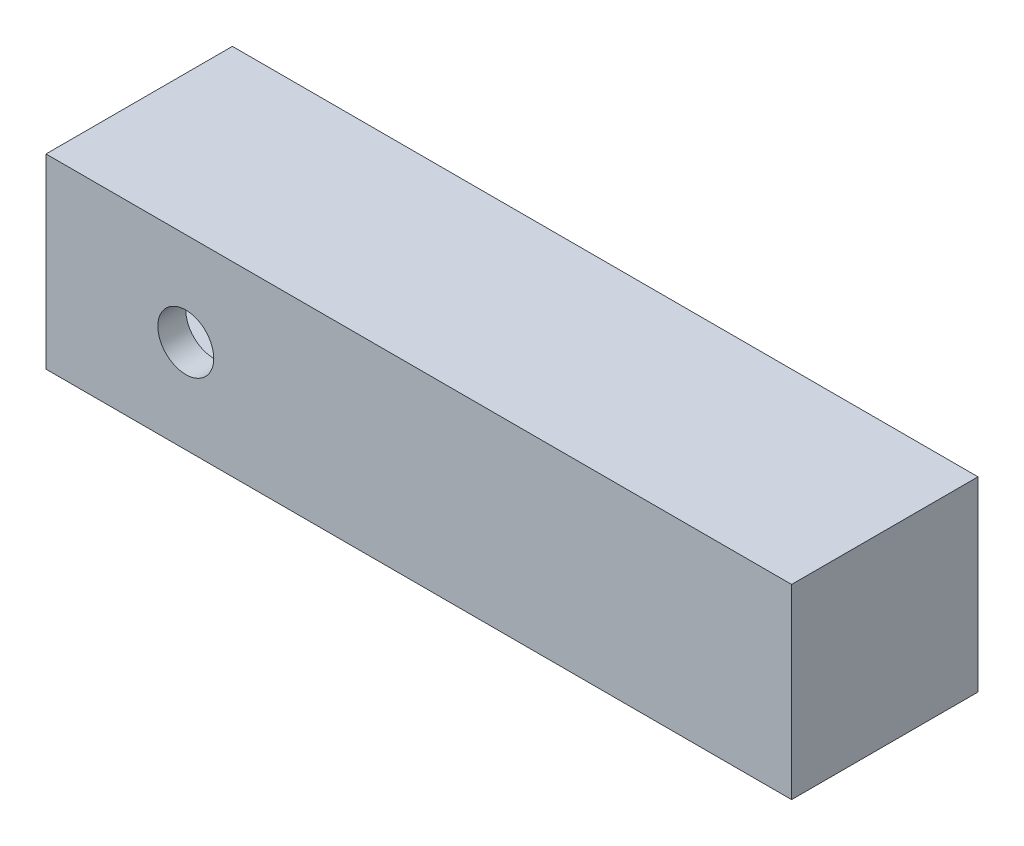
ISO-10303-21;
HEADER;
FILE_DESCRIPTION(('STEP AP214'),'2;1');
FILE_NAME('part.step','',(''),(''),'','','');
FILE_SCHEMA(('AUTOMOTIVE_DESIGN { 1 0 10303 214 1 1 1 1 }'));
ENDSEC;
DATA;
#1=APPLICATION_CONTEXT('core data for automotive mechanical design processes');
#2=APPLICATION_PROTOCOL_DEFINITION('international standard','automotive_design',2000,#1);
#3=PRODUCT_CONTEXT('',#1,'mechanical');
#4=PRODUCT('Part','Part','',(#3));
#5=PRODUCT_RELATED_PRODUCT_CATEGORY('part','',(#4));
#6=PRODUCT_DEFINITION_FORMATION('','',#4);
#7=PRODUCT_DEFINITION_CONTEXT('part definition',#1,'design');
#8=PRODUCT_DEFINITION('design','',#6,#7);
#9=PRODUCT_DEFINITION_SHAPE('','',#8);
#10=(LENGTH_UNIT() NAMED_UNIT(*) SI_UNIT(.MILLI.,.METRE.));
#11=(NAMED_UNIT(*) PLANE_ANGLE_UNIT() SI_UNIT($,.RADIAN.));
#12=(NAMED_UNIT(*) SI_UNIT($,.STERADIAN.) SOLID_ANGLE_UNIT());
#13=UNCERTAINTY_MEASURE_WITH_UNIT(LENGTH_MEASURE(1.E-05),#10,'distance_accuracy_value','');
#14=(GEOMETRIC_REPRESENTATION_CONTEXT(3) GLOBAL_UNCERTAINTY_ASSIGNED_CONTEXT((#13)) GLOBAL_UNIT_ASSIGNED_CONTEXT((#10,
#11,#12)) REPRESENTATION_CONTEXT('',''));
#15=CARTESIAN_POINT('',(0.,0.,0.));
#16=DIRECTION('',(0.,0.,1.));
#17=DIRECTION('',(1.,0.,0.));
#18=AXIS2_PLACEMENT_3D('',#15,#16,#17);
#19=CARTESIAN_POINT('',(0.,-25.4,12.7));
#20=DIRECTION('',(1.,0.,0.));
#21=DIRECTION('',(0.,0.,-1.));
#22=AXIS2_PLACEMENT_3D('',#19,#20,#21);
#23=PLANE('',#22);
#24=DIRECTION('',(0.,-1.,0.));
#25=VECTOR('',#24,1.);
#26=CARTESIAN_POINT('',(0.,-25.4,-12.7));
#27=LINE('',#26,#25);
#28=CARTESIAN_POINT('',(0.,0.,-12.7));
#29=VERTEX_POINT('',#28);
#30=CARTESIAN_POINT('',(0.,-25.4,-12.7));
#31=VERTEX_POINT('',#30);
#32=EDGE_CURVE('E208',#29,#31,#27,.T.);
#33=ORIENTED_EDGE('',*,*,#32,.T.);
#34=DIRECTION('',(0.,0.,-1.));
#35=VECTOR('',#34,1.);
#36=CARTESIAN_POINT('',(0.,-25.4,12.7));
#37=LINE('',#36,#35);
#38=CARTESIAN_POINT('',(0.,-25.4,12.7));
#39=VERTEX_POINT('',#38);
#40=EDGE_CURVE('E11',#39,#31,#37,.T.);
#41=ORIENTED_EDGE('',*,*,#40,.F.);
#42=DIRECTION('',(0.,-1.,0.));
#43=VECTOR('',#42,1.);
#44=CARTESIAN_POINT('',(0.,-25.4,12.7));
#45=LINE('',#44,#43);
#46=CARTESIAN_POINT('',(0.,0.,12.7));
#47=VERTEX_POINT('',#46);
#48=EDGE_CURVE('E193',#47,#39,#45,.T.);
#49=ORIENTED_EDGE('',*,*,#48,.F.);
#50=DIRECTION('',(0.,0.,-1.));
#51=VECTOR('',#50,1.);
#52=CARTESIAN_POINT('',(0.,0.,12.7));
#53=LINE('',#52,#51);
#54=EDGE_CURVE('E207',#47,#29,#53,.T.);
#55=ORIENTED_EDGE('',*,*,#54,.T.);
#56=EDGE_LOOP('',(#33,#41,#49,#55));
#57=FACE_BOUND('',#56,.T.);
#58=DIRECTION('',(0.,0.,1.));
#59=VECTOR('',#58,1.);
#60=CARTESIAN_POINT('',(0.,-3.81,-8.89));
#61=LINE('',#60,#59);
#62=CARTESIAN_POINT('',(0.,-3.81,-8.89));
#63=VERTEX_POINT('',#62);
#64=CARTESIAN_POINT('',(0.,-3.81,8.89));
#65=VERTEX_POINT('',#64);
#66=EDGE_CURVE('E162',#63,#65,#61,.T.);
#67=ORIENTED_EDGE('',*,*,#66,.T.);
#68=DIRECTION('',(0.,-1.,0.));
#69=VECTOR('',#68,1.);
#70=CARTESIAN_POINT('',(0.,-3.81,8.89));
#71=LINE('',#70,#69);
#72=CARTESIAN_POINT('',(0.,-21.59,8.89));
#73=VERTEX_POINT('',#72);
#74=EDGE_CURVE('E262',#65,#73,#71,.T.);
#75=ORIENTED_EDGE('',*,*,#74,.T.);
#76=DIRECTION('',(0.,0.,-1.));
#77=VECTOR('',#76,1.);
#78=CARTESIAN_POINT('',(0.,-21.59,-8.89));
#79=LINE('',#78,#77);
#80=CARTESIAN_POINT('',(0.,-21.59,-8.89));
#81=VERTEX_POINT('',#80);
#82=EDGE_CURVE('E192',#73,#81,#79,.T.);
#83=ORIENTED_EDGE('',*,*,#82,.T.);
#84=DIRECTION('',(0.,1.,0.));
#85=VECTOR('',#84,1.);
#86=CARTESIAN_POINT('',(0.,-3.81,-8.89));
#87=LINE('',#86,#85);
#88=EDGE_CURVE('E127',#81,#63,#87,.T.);
#89=ORIENTED_EDGE('',*,*,#88,.T.);
#90=EDGE_LOOP('',(#67,#75,#83,#89));
#91=FACE_BOUND('',#90,.T.);
#92=ADVANCED_FACE('F45',(#57,#91),#23,.F.);
#93=CARTESIAN_POINT('',(101.6,-25.4,12.7));
#94=DIRECTION('',(0.,1.,0.));
#95=DIRECTION('',(-1.,0.,0.));
#96=AXIS2_PLACEMENT_3D('',#93,#94,#95);
#97=PLANE('',#96);
#98=DIRECTION('',(1.,0.,0.));
#99=VECTOR('',#98,1.);
#100=CARTESIAN_POINT('',(101.6,-25.4,-12.7));
#101=LINE('',#100,#99);
#102=CARTESIAN_POINT('',(101.6,-25.4,-12.7));
#103=VERTEX_POINT('',#102);
#104=EDGE_CURVE('E212',#31,#103,#101,.T.);
#105=ORIENTED_EDGE('',*,*,#104,.T.);
#106=DIRECTION('',(0.,0.,-1.));
#107=VECTOR('',#106,1.);
#108=CARTESIAN_POINT('',(101.6,-25.4,12.7));
#109=LINE('',#108,#107);
#110=CARTESIAN_POINT('',(101.6,-25.4,12.7));
#111=VERTEX_POINT('',#110);
#112=EDGE_CURVE('E54',#111,#103,#109,.T.);
#113=ORIENTED_EDGE('',*,*,#112,.F.);
#114=DIRECTION('',(1.,0.,0.));
#115=VECTOR('',#114,1.);
#116=CARTESIAN_POINT('',(101.6,-25.4,12.7));
#117=LINE('',#116,#115);
#118=EDGE_CURVE('E197',#39,#111,#117,.T.);
#119=ORIENTED_EDGE('',*,*,#118,.F.);
#120=ORIENTED_EDGE('',*,*,#40,.T.);
#121=EDGE_LOOP('',(#105,#113,#119,#120));
#122=FACE_BOUND('',#121,.T.);
#123=DIRECTION('',(-1.,0.,0.));
#124=VECTOR('',#123,1.);
#125=CARTESIAN_POINT('',(81.4073636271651,-25.4,-8.89));
#126=LINE('',#125,#124);
#127=CARTESIAN_POINT('',(81.4073636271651,-25.4,-8.89));
#128=VERTEX_POINT('',#127);
#129=CARTESIAN_POINT('',(63.6273636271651,-25.4,-8.89));
#130=VERTEX_POINT('',#129);
#131=EDGE_CURVE('E191',#128,#130,#126,.T.);
#132=ORIENTED_EDGE('',*,*,#131,.T.);
#133=DIRECTION('',(0.,0.,1.));
#134=VECTOR('',#133,1.);
#135=CARTESIAN_POINT('',(63.6273636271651,-25.4,-8.89));
#136=LINE('',#135,#134);
#137=CARTESIAN_POINT('',(63.6273636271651,-25.4,8.89));
#138=VERTEX_POINT('',#137);
#139=EDGE_CURVE('E151',#130,#138,#136,.T.);
#140=ORIENTED_EDGE('',*,*,#139,.T.);
#141=DIRECTION('',(1.,0.,0.));
#142=VECTOR('',#141,1.);
#143=CARTESIAN_POINT('',(81.4073636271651,-25.4,8.89));
#144=LINE('',#143,#142);
#145=CARTESIAN_POINT('',(81.4073636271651,-25.4,8.89));
#146=VERTEX_POINT('',#145);
#147=EDGE_CURVE('E213',#138,#146,#144,.T.);
#148=ORIENTED_EDGE('',*,*,#147,.T.);
#149=DIRECTION('',(0.,0.,-1.));
#150=VECTOR('',#149,1.);
#151=CARTESIAN_POINT('',(81.4073636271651,-25.4,-8.89));
#152=LINE('',#151,#150);
#153=EDGE_CURVE('E187',#146,#128,#152,.T.);
#154=ORIENTED_EDGE('',*,*,#153,.T.);
#155=EDGE_LOOP('',(#132,#140,#148,#154));
#156=FACE_BOUND('',#155,.T.);
#157=ADVANCED_FACE('F251',(#122,#156),#97,.F.);
#158=CARTESIAN_POINT('',(101.6,0.,12.7));
#159=DIRECTION('',(-1.,0.,0.));
#160=DIRECTION('',(0.,0.,1.));
#161=AXIS2_PLACEMENT_3D('',#158,#159,#160);
#162=PLANE('',#161);
#163=DIRECTION('',(0.,1.,0.));
#164=VECTOR('',#163,1.);
#165=CARTESIAN_POINT('',(101.6,0.,-12.7));
#166=LINE('',#165,#164);
#167=CARTESIAN_POINT('',(101.6,0.,-12.7));
#168=VERTEX_POINT('',#167);
#169=EDGE_CURVE('E216',#103,#168,#166,.T.);
#170=ORIENTED_EDGE('',*,*,#169,.T.);
#171=DIRECTION('',(0.,0.,-1.));
#172=VECTOR('',#171,1.);
#173=CARTESIAN_POINT('',(101.6,0.,12.7));
#174=LINE('',#173,#172);
#175=CARTESIAN_POINT('',(101.6,0.,12.7));
#176=VERTEX_POINT('',#175);
#177=EDGE_CURVE('E224',#176,#168,#174,.T.);
#178=ORIENTED_EDGE('',*,*,#177,.F.);
#179=DIRECTION('',(0.,1.,0.));
#180=VECTOR('',#179,1.);
#181=CARTESIAN_POINT('',(101.6,0.,12.7));
#182=LINE('',#181,#180);
#183=EDGE_CURVE('E201',#111,#176,#182,.T.);
#184=ORIENTED_EDGE('',*,*,#183,.F.);
#185=ORIENTED_EDGE('',*,*,#112,.T.);
#186=EDGE_LOOP('',(#170,#178,#184,#185));
#187=FACE_BOUND('',#186,.T.);
#188=ADVANCED_FACE('F234',(#187),#162,.F.);
#189=CARTESIAN_POINT('',(0.,0.,12.7));
#190=DIRECTION('',(0.,-1.,0.));
#191=DIRECTION('',(0.,0.,-1.));
#192=AXIS2_PLACEMENT_3D('',#189,#190,#191);
#193=PLANE('',#192);
#194=DIRECTION('',(-1.,0.,0.));
#195=VECTOR('',#194,1.);
#196=CARTESIAN_POINT('',(0.,0.,-12.7));
#197=LINE('',#196,#195);
#198=EDGE_CURVE('E198',#168,#29,#197,.T.);
#199=ORIENTED_EDGE('',*,*,#198,.T.);
#200=ORIENTED_EDGE('',*,*,#54,.F.);
#201=DIRECTION('',(-1.,0.,0.));
#202=VECTOR('',#201,1.);
#203=CARTESIAN_POINT('',(0.,0.,12.7));
#204=LINE('',#203,#202);
#205=EDGE_CURVE('E204',#176,#47,#204,.T.);
#206=ORIENTED_EDGE('',*,*,#205,.F.);
#207=ORIENTED_EDGE('',*,*,#177,.T.);
#208=EDGE_LOOP('',(#199,#200,#206,#207));
#209=FACE_BOUND('',#208,.T.);
#210=ADVANCED_FACE('F243',(#209),#193,.F.);
#211=CARTESIAN_POINT('',(0.,0.,12.7));
#212=DIRECTION('',(0.,0.,-1.));
#213=DIRECTION('',(-1.,0.,0.));
#214=AXIS2_PLACEMENT_3D('',#211,#212,#213);
#215=PLANE('',#214);
#216=CARTESIAN_POINT('',(19.05,-12.7,12.7));
#217=DIRECTION('',(0.,0.,1.));
#218=DIRECTION('',(1.,0.,0.));
#219=AXIS2_PLACEMENT_3D('',#216,#217,#218);
#220=CIRCLE('',#219,3.81);
#221=CARTESIAN_POINT('',(22.86,-12.7,12.7));
#222=VERTEX_POINT('',#221);
#223=EDGE_CURVE('E382',#222,#222,#220,.T.);
#224=ORIENTED_EDGE('',*,*,#223,.F.);
#225=EDGE_LOOP('',(#224));
#226=FACE_BOUND('',#225,.T.);
#227=ORIENTED_EDGE('',*,*,#48,.T.);
#228=ORIENTED_EDGE('',*,*,#118,.T.);
#229=ORIENTED_EDGE('',*,*,#183,.T.);
#230=ORIENTED_EDGE('',*,*,#205,.T.);
#231=EDGE_LOOP('',(#227,#228,#229,#230));
#232=FACE_BOUND('',#231,.T.);
#233=ADVANCED_FACE('F250',(#226,#232),#215,.F.);
#234=CARTESIAN_POINT('',(0.,0.,-12.7));
#235=DIRECTION('',(0.,0.,-1.));
#236=DIRECTION('',(-1.,0.,0.));
#237=AXIS2_PLACEMENT_3D('',#234,#235,#236);
#238=PLANE('',#237);
#239=CARTESIAN_POINT('',(19.05,-12.7,-12.7));
#240=DIRECTION('',(0.,0.,1.));
#241=DIRECTION('',(1.,0.,0.));
#242=AXIS2_PLACEMENT_3D('',#239,#240,#241);
#243=CIRCLE('',#242,3.81);
#244=CARTESIAN_POINT('',(22.86,-12.7,-12.7));
#245=VERTEX_POINT('',#244);
#246=EDGE_CURVE('E385',#245,#245,#243,.T.);
#247=ORIENTED_EDGE('',*,*,#246,.T.);
#248=EDGE_LOOP('',(#247));
#249=FACE_BOUND('',#248,.T.);
#250=ORIENTED_EDGE('',*,*,#32,.F.);
#251=ORIENTED_EDGE('',*,*,#198,.F.);
#252=ORIENTED_EDGE('',*,*,#169,.F.);
#253=ORIENTED_EDGE('',*,*,#104,.F.);
#254=EDGE_LOOP('',(#250,#251,#252,#253));
#255=FACE_BOUND('',#254,.T.);
#256=ADVANCED_FACE('F240',(#249,#255),#238,.T.);
#257=CARTESIAN_POINT('',(81.4073636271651,-2.82100000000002,-8.89));
#258=DIRECTION('',(0.,0.,1.));
#259=DIRECTION('',(1.,0.,0.));
#260=AXIS2_PLACEMENT_3D('',#257,#258,#259);
#261=PLANE('',#260);
#262=DIRECTION('',(0.,-1.,0.));
#263=VECTOR('',#262,1.);
#264=CARTESIAN_POINT('',(81.4073636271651,-2.82100000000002,-8.89));
#265=LINE('',#264,#263);
#266=CARTESIAN_POINT('',(81.4073636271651,-3.81000000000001,-8.89));
#267=VERTEX_POINT('',#266);
#268=EDGE_CURVE('E69',#267,#128,#265,.T.);
#269=ORIENTED_EDGE('',*,*,#268,.F.);
#270=DIRECTION('',(0.707106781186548,0.707106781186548,0.));
#271=VECTOR('',#270,1.);
#272=CARTESIAN_POINT('',(38.7036818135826,-46.5136818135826,-8.89));
#273=LINE('',#272,#271);
#274=CARTESIAN_POINT('',(63.6273636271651,-21.59,-8.89));
#275=VERTEX_POINT('',#274);
#276=EDGE_CURVE('E125',#275,#267,#273,.T.);
#277=ORIENTED_EDGE('',*,*,#276,.F.);
#278=DIRECTION('',(0.,-1.,0.));
#279=VECTOR('',#278,1.);
#280=CARTESIAN_POINT('',(63.6273636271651,-2.82100000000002,-8.89));
#281=LINE('',#280,#279);
#282=EDGE_CURVE('E138',#275,#130,#281,.T.);
#283=ORIENTED_EDGE('',*,*,#282,.T.);
#284=ORIENTED_EDGE('',*,*,#131,.F.);
#285=EDGE_LOOP('',(#269,#277,#283,#284));
#286=FACE_BOUND('',#285,.T.);
#287=ADVANCED_FACE('F137',(#286),#261,.T.);
#288=CARTESIAN_POINT('',(63.6273636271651,-2.82100000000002,-8.89));
#289=DIRECTION('',(1.,0.,0.));
#290=DIRECTION('',(0.,0.,-1.));
#291=AXIS2_PLACEMENT_3D('',#288,#289,#290);
#292=PLANE('',#291);
#293=ORIENTED_EDGE('',*,*,#282,.F.);
#294=DIRECTION('',(0.,0.,-1.));
#295=VECTOR('',#294,1.);
#296=CARTESIAN_POINT('',(63.6273636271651,-21.59,-8.89));
#297=LINE('',#296,#295);
#298=CARTESIAN_POINT('',(63.6273636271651,-21.59,8.89));
#299=VERTEX_POINT('',#298);
#300=EDGE_CURVE('E148',#299,#275,#297,.T.);
#301=ORIENTED_EDGE('',*,*,#300,.F.);
#302=DIRECTION('',(0.,-1.,0.));
#303=VECTOR('',#302,1.);
#304=CARTESIAN_POINT('',(63.6273636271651,-2.82100000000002,8.89));
#305=LINE('',#304,#303);
#306=EDGE_CURVE('E153',#299,#138,#305,.T.);
#307=ORIENTED_EDGE('',*,*,#306,.T.);
#308=ORIENTED_EDGE('',*,*,#139,.F.);
#309=EDGE_LOOP('',(#293,#301,#307,#308));
#310=FACE_BOUND('',#309,.T.);
#311=ADVANCED_FACE('F146',(#310),#292,.T.);
#312=CARTESIAN_POINT('',(81.4073636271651,-2.82100000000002,8.89));
#313=DIRECTION('',(0.,0.,-1.));
#314=DIRECTION('',(-1.,0.,0.));
#315=AXIS2_PLACEMENT_3D('',#312,#313,#314);
#316=PLANE('',#315);
#317=ORIENTED_EDGE('',*,*,#306,.F.);
#318=DIRECTION('',(-0.707106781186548,-0.707106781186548,0.));
#319=VECTOR('',#318,1.);
#320=CARTESIAN_POINT('',(38.7036818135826,-46.5136818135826,8.89000000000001));
#321=LINE('',#320,#319);
#322=CARTESIAN_POINT('',(81.4073636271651,-3.81000000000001,8.89));
#323=VERTEX_POINT('',#322);
#324=EDGE_CURVE('E158',#323,#299,#321,.T.);
#325=ORIENTED_EDGE('',*,*,#324,.F.);
#326=DIRECTION('',(0.,-1.,0.));
#327=VECTOR('',#326,1.);
#328=CARTESIAN_POINT('',(81.4073636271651,-2.82100000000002,8.89));
#329=LINE('',#328,#327);
#330=EDGE_CURVE('E178',#323,#146,#329,.T.);
#331=ORIENTED_EDGE('',*,*,#330,.T.);
#332=ORIENTED_EDGE('',*,*,#147,.F.);
#333=EDGE_LOOP('',(#317,#325,#331,#332));
#334=FACE_BOUND('',#333,.T.);
#335=ADVANCED_FACE('F275',(#334),#316,.T.);
#336=CARTESIAN_POINT('',(81.4073636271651,-2.82100000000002,-8.89));
#337=DIRECTION('',(-1.,0.,0.));
#338=DIRECTION('',(0.,0.,1.));
#339=AXIS2_PLACEMENT_3D('',#336,#337,#338);
#340=PLANE('',#339);
#341=ORIENTED_EDGE('',*,*,#330,.F.);
#342=DIRECTION('',(0.,0.,1.));
#343=VECTOR('',#342,1.);
#344=CARTESIAN_POINT('',(81.4073636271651,-3.81,-8.89));
#345=LINE('',#344,#343);
#346=EDGE_CURVE('E141',#267,#323,#345,.T.);
#347=ORIENTED_EDGE('',*,*,#346,.F.);
#348=ORIENTED_EDGE('',*,*,#268,.T.);
#349=ORIENTED_EDGE('',*,*,#153,.F.);
#350=EDGE_LOOP('',(#341,#347,#348,#349));
#351=FACE_BOUND('',#350,.T.);
#352=ADVANCED_FACE('F276',(#351),#340,.T.);
#353=CARTESIAN_POINT('',(-4.,-3.81,-8.89));
#354=DIRECTION('',(0.,-1.,0.));
#355=DIRECTION('',(0.,0.,-1.));
#356=AXIS2_PLACEMENT_3D('',#353,#354,#355);
#357=PLANE('',#356);
#358=DIRECTION('',(1.,0.,0.));
#359=VECTOR('',#358,1.);
#360=CARTESIAN_POINT('',(-4.,-3.81,-8.89));
#361=LINE('',#360,#359);
#362=EDGE_CURVE('E61',#63,#267,#361,.T.);
#363=ORIENTED_EDGE('',*,*,#362,.T.);
#364=ORIENTED_EDGE('',*,*,#346,.T.);
#365=DIRECTION('',(1.,0.,0.));
#366=VECTOR('',#365,1.);
#367=CARTESIAN_POINT('',(-4.,-3.81,8.89));
#368=LINE('',#367,#366);
#369=EDGE_CURVE('E142',#65,#323,#368,.T.);
#370=ORIENTED_EDGE('',*,*,#369,.F.);
#371=ORIENTED_EDGE('',*,*,#66,.F.);
#372=EDGE_LOOP('',(#363,#364,#370,#371));
#373=FACE_BOUND('',#372,.T.);
#374=ADVANCED_FACE('F269',(#373),#357,.T.);
#375=CARTESIAN_POINT('',(-4.,-3.81,8.89));
#376=DIRECTION('',(0.,0.,-1.));
#377=DIRECTION('',(0.,1.,0.));
#378=AXIS2_PLACEMENT_3D('',#375,#376,#377);
#379=PLANE('',#378);
#380=CARTESIAN_POINT('',(19.05,-12.7,8.89));
#381=DIRECTION('',(0.,0.,-1.));
#382=DIRECTION('',(0.,1.,0.));
#383=AXIS2_PLACEMENT_3D('',#380,#381,#382);
#384=CIRCLE('',#383,3.81);
#385=CARTESIAN_POINT('',(19.05,-8.89,8.89));
#386=VERTEX_POINT('',#385);
#387=EDGE_CURVE('E182',#386,#386,#384,.T.);
#388=ORIENTED_EDGE('',*,*,#387,.F.);
#389=EDGE_LOOP('',(#388));
#390=FACE_BOUND('',#389,.T.);
#391=ORIENTED_EDGE('',*,*,#369,.T.);
#392=ORIENTED_EDGE('',*,*,#324,.T.);
#393=DIRECTION('',(1.,0.,0.));
#394=VECTOR('',#393,1.);
#395=CARTESIAN_POINT('',(-4.,-21.59,8.89));
#396=LINE('',#395,#394);
#397=EDGE_CURVE('E132',#73,#299,#396,.T.);
#398=ORIENTED_EDGE('',*,*,#397,.F.);
#399=ORIENTED_EDGE('',*,*,#74,.F.);
#400=EDGE_LOOP('',(#391,#392,#398,#399));
#401=FACE_BOUND('',#400,.T.);
#402=ADVANCED_FACE('F272',(#390,#401),#379,.T.);
#403=CARTESIAN_POINT('',(-4.,-21.59,-8.89));
#404=DIRECTION('',(0.,1.,0.));
#405=DIRECTION('',(0.,0.,1.));
#406=AXIS2_PLACEMENT_3D('',#403,#404,#405);
#407=PLANE('',#406);
#408=ORIENTED_EDGE('',*,*,#397,.T.);
#409=ORIENTED_EDGE('',*,*,#300,.T.);
#410=DIRECTION('',(1.,0.,0.));
#411=VECTOR('',#410,1.);
#412=CARTESIAN_POINT('',(-4.,-21.59,-8.89));
#413=LINE('',#412,#411);
#414=EDGE_CURVE('E122',#81,#275,#413,.T.);
#415=ORIENTED_EDGE('',*,*,#414,.F.);
#416=ORIENTED_EDGE('',*,*,#82,.F.);
#417=EDGE_LOOP('',(#408,#409,#415,#416));
#418=FACE_BOUND('',#417,.T.);
#419=ADVANCED_FACE('F155',(#418),#407,.T.);
#420=CARTESIAN_POINT('',(-4.,-3.81,-8.89));
#421=DIRECTION('',(0.,0.,1.));
#422=DIRECTION('',(0.,-1.,0.));
#423=AXIS2_PLACEMENT_3D('',#420,#421,#422);
#424=PLANE('',#423);
#425=CARTESIAN_POINT('',(19.05,-12.7,-8.89));
#426=DIRECTION('',(0.,0.,1.));
#427=DIRECTION('',(0.,-1.,0.));
#428=AXIS2_PLACEMENT_3D('',#425,#426,#427);
#429=CIRCLE('',#428,3.81);
#430=CARTESIAN_POINT('',(19.05,-16.51,-8.89));
#431=VERTEX_POINT('',#430);
#432=EDGE_CURVE('E48',#431,#431,#429,.T.);
#433=ORIENTED_EDGE('',*,*,#432,.F.);
#434=EDGE_LOOP('',(#433));
#435=FACE_BOUND('',#434,.T.);
#436=ORIENTED_EDGE('',*,*,#414,.T.);
#437=ORIENTED_EDGE('',*,*,#276,.T.);
#438=ORIENTED_EDGE('',*,*,#362,.F.);
#439=ORIENTED_EDGE('',*,*,#88,.F.);
#440=EDGE_LOOP('',(#436,#437,#438,#439));
#441=FACE_BOUND('',#440,.T.);
#442=ADVANCED_FACE('F124',(#435,#441),#424,.T.);
#443=CARTESIAN_POINT('',(19.05,-12.7,-12.7));
#444=DIRECTION('',(0.,0.,1.));
#445=DIRECTION('',(1.,0.,0.));
#446=AXIS2_PLACEMENT_3D('',#443,#444,#445);
#447=CYLINDRICAL_SURFACE('',#446,3.81);
#448=ORIENTED_EDGE('',*,*,#432,.T.);
#449=EDGE_LOOP('',(#448));
#450=FACE_BOUND('',#449,.T.);
#451=ORIENTED_EDGE('',*,*,#246,.F.);
#452=EDGE_LOOP('',(#451));
#453=FACE_BOUND('',#452,.T.);
#454=ADVANCED_FACE('F306',(#450,#453),#447,.F.);
#455=ORIENTED_EDGE('',*,*,#387,.T.);
#456=EDGE_LOOP('',(#455));
#457=FACE_BOUND('',#456,.T.);
#458=ORIENTED_EDGE('',*,*,#223,.T.);
#459=EDGE_LOOP('',(#458));
#460=FACE_BOUND('',#459,.T.);
#461=ADVANCED_FACE('F365',(#457,#460),#447,.F.);
#462=CLOSED_SHELL('',(#92,#157,#188,#210,#233,#256,#287,#311,#335,#352,#374,#402,#419,#442,#454,#461));
#463=MANIFOLD_SOLID_BREP('B2',#462);
#464=ADVANCED_BREP_SHAPE_REPRESENTATION('',(#18,#463),#14);
#465=SHAPE_DEFINITION_REPRESENTATION(#9,#464);
ENDSEC;
END-ISO-10303-21;
